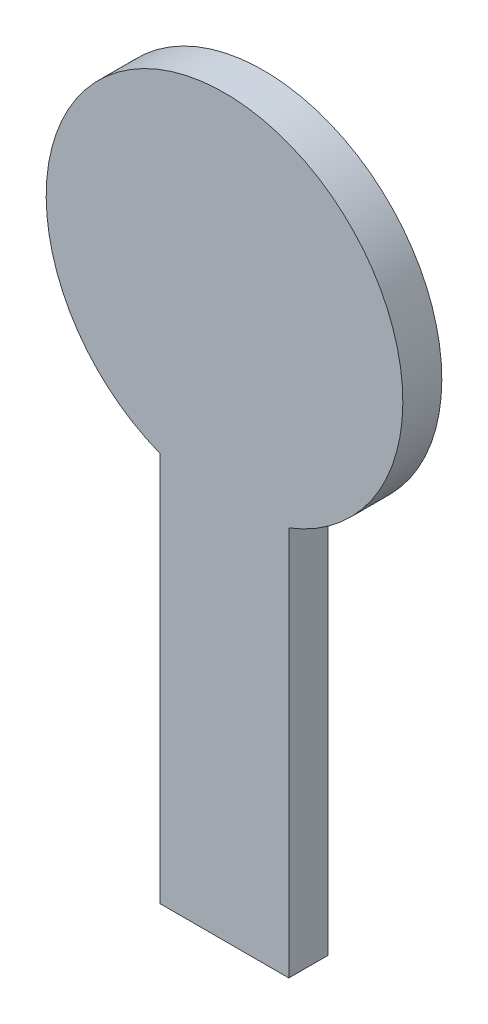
from build123d import *

# Parameters (mm, degrees)
BOSS_EXTRUDE1_DEPTH = 2


with BuildPart() as part:
    # Sketch1 → Boss-Extrude1 (new body)
    with BuildSketch(Plane.XY):
        with BuildLine():
            Line((-3.3, -28.53419592), (3.3, -28.53419592))
            Line((3.3, -28.53419592), (3.3, -8.53419592))
            ThreePointArc((3.3, -8.53419592), (0, 9.15), (-3.3, -8.53419592))
            Line((-3.3, -8.53419592), (-3.3, -28.53419592))
        make_face()
    extrude(amount=BOSS_EXTRUDE1_DEPTH)


solid = part.part
